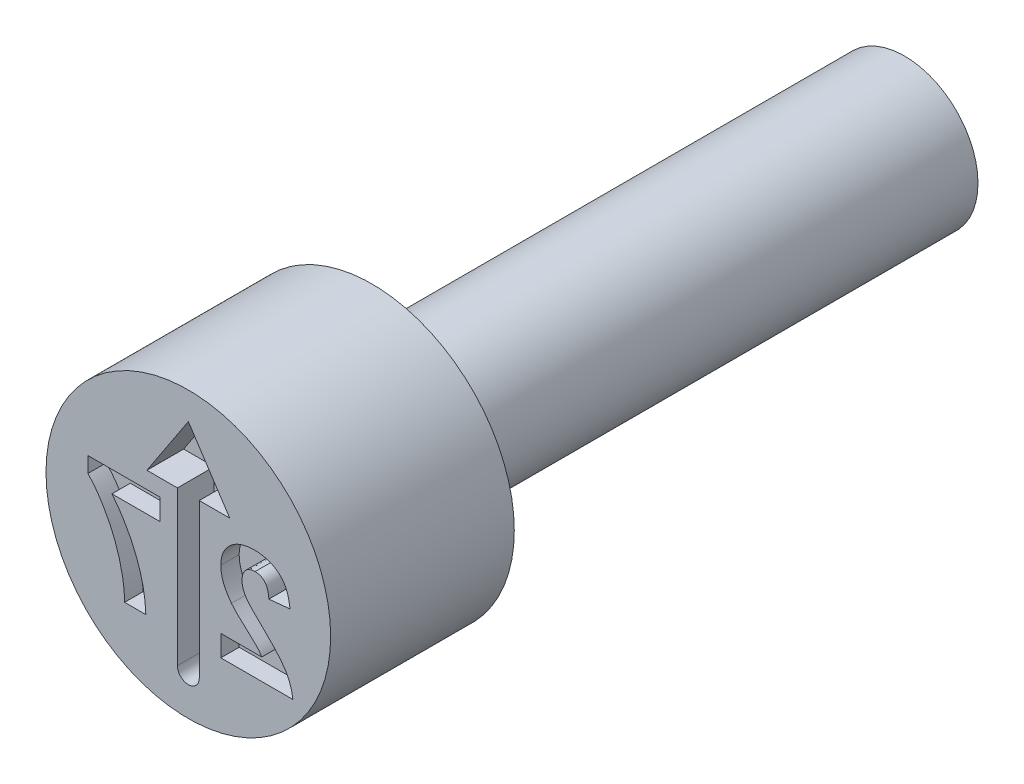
from build123d import *

# Parameters (mm, degrees)
CUT_EXTRUDE4_DEPTH = 0.4
CUT_EXTRUDE5_DEPTH = 0.2


with BuildPart() as part:
    # Sketch2 → Revolve1 (revolve)
    with BuildSketch(Plane(origin=(0, 0, 0), x_dir=(0, 0, -1), z_dir=(1, 0, 0)), mode=Mode.PRIVATE) as revolve1_sk:
        Polygon((0, 1.55), (0, 0), (7.8, 0), (7.8, 0.8), (2, 0.8), (2, 1.55), align=None)
    revolve(revolve1_sk.sketch.rotate(Axis((0, 0, -0.403888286), (0, 0, -1)), 90), axis=Axis((0, 0, -0.403888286), (0, 0, -1)))

    # Sketch3 → Cut-Extrude4 (cut)
    with BuildSketch(Plane.XY):
        with BuildLine():
            Line((0.119045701, 0.566469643), (0.119045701, -1.110101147))
            ThreePointArc((0.119045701, -1.110101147), (0, -1.229146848), (-0.119045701, -1.110101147))
            Line((-0.119045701, -1.110101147), (-0.119045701, 0.566469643))
            Line((-0.119045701, 0.566469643), (-0.451198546, 0.566469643))
            Line((-0.451198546, 0.566469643), (0, 1.251322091))
            Line((0, 1.251322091), (0.451198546, 0.566469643))
            Line((0.451198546, 0.566469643), (0.119045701, 0.566469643))
        make_face()
    extrude(amount=-CUT_EXTRUDE4_DEPTH, mode=Mode.SUBTRACT)

    # Sketch4 → Cut-Extrude5 (cut)
    with BuildSketch(Plane.XY):
        with BuildLine():
            Line((0.353846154, -0.569230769), (0.353846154, -0.8))
            Line((0.353846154, -0.8), (1.138461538, -0.8))
            add(Edge.make_bspline(
                [(1.138461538, -0.8), (1.135805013, -0.780277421), (1.13049345, -0.740843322), (1.114071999, -0.683240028), (1.092154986, -0.627029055), (1.068368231, -0.581286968), (1.044709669, -0.544466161), (1.023244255, -0.514294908), (0.997636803, -0.482193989), (0.968258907, -0.447904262), (0.935272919, -0.411318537), (0.898432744, -0.372572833), (0.857562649, -0.331852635), (0.828809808, -0.304201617), (0.813942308, -0.289903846)],
                knots=[0, 0, 0, 0, 1.156289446, 2.311930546, 3.473459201, 4.661751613, 5.303057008, 6.018253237, 6.81459331, 7.690699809, 8.644447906, 9.679642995, 10.800191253, 12, 12, 12, 12], degree=3))
            add(Edge.make_bspline(
                [(0.813942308, -0.289903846), (0.802077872, -0.278451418), (0.779491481, -0.256649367), (0.747328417, -0.225429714), (0.719053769, -0.196729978), (0.694076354, -0.171293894), (0.672973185, -0.148473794), (0.65546667, -0.128628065), (0.641335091, -0.111675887), (0.633681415, -0.100921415), (0.630288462, -0.096153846)],
                knots=[0, 0, 0, 0, 1.480720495, 2.818855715, 4.024636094, 5.098235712, 6.019786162, 6.815086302, 7.474715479, 8, 8, 8, 8], degree=3))
            add(Edge.make_bspline(
                [(0.630288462, -0.096153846), (0.623340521, -0.084612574), (0.609938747, -0.062350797), (0.595242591, -0.02734375), (0.58642141, 0.007656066), (0.585210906, 0.031042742), (0.584615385, 0.042548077)],
                knots=[0, 0, 0, 0, 1.0911822, 2.104764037, 3.067617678, 4, 4, 4, 4], degree=3))
            add(Edge.make_bspline(
                [(0.584615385, 0.042548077), (0.585047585, 0.054520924), (0.585865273, 0.077172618), (0.592721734, 0.109138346), (0.604880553, 0.136617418), (0.621621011, 0.159694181), (0.642789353, 0.177774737), (0.66753576, 0.191134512), (0.69622248, 0.198520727), (0.716385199, 0.199492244), (0.726923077, 0.2)],
                knots=[0, 0, 0, 0, 1.193122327, 2.257294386, 3.237245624, 4.168877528, 5.075331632, 5.990371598, 6.949684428, 8, 8, 8, 8], degree=3))
            add(Edge.make_bspline(
                [(0.726923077, 0.2), (0.737389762, 0.199525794), (0.757609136, 0.198609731), (0.786345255, 0.190607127), (0.811484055, 0.176753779), (0.829399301, 0.160966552), (0.8415019, 0.14561462), (0.849748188, 0.132236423), (0.856855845, 0.117034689), (0.863153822, 0.100180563), (0.868128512, 0.081480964), (0.872134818, 0.061078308), (0.875363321, 0.0388628), (0.876390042, 0.023408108), (0.876923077, 0.015384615)],
                knots=[0, 0, 0, 0, 1.402788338, 2.709884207, 3.961032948, 5.225417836, 5.883680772, 6.578928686, 7.329201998, 8.132101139, 8.990263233, 9.922304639, 10.921339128, 12, 12, 12, 12], degree=3))
            Line((0.876923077, 0.015384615), (1.107692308, 0.037980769))
            add(Edge.make_bspline(
                [(1.107692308, 0.037980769), (1.105836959, 0.053560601), (1.102239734, 0.083767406), (1.093262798, 0.127154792), (1.081893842, 0.167181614), (1.067590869, 0.20377359), (1.050945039, 0.237163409), (1.031107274, 0.266850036), (1.008770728, 0.293162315), (0.983916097, 0.316086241), (0.95670139, 0.335694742), (0.928144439, 0.353198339), (0.897687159, 0.367556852), (0.865664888, 0.379390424), (0.832092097, 0.38884772), (0.796813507, 0.395100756), (0.760046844, 0.399499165), (0.734949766, 0.399830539), (0.722115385, 0.4)],
                knots=[0, 0, 0, 0, 1.270971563, 2.464210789, 3.586263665, 4.638946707, 5.643716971, 6.603612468, 7.52484387, 8.434700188, 9.336036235, 10.239171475, 11.145359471, 12.059630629, 13.003312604, 13.96741569, 14.960557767, 16, 16, 16, 16], degree=3))
            add(Edge.make_bspline(
                [(0.722115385, 0.4), (0.708162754, 0.399731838), (0.680988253, 0.399209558), (0.641318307, 0.394896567), (0.604051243, 0.387376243), (0.568861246, 0.37741451), (0.536109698, 0.364114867), (0.505523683, 0.348036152), (0.47758457, 0.328568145), (0.451875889, 0.30677252), (0.428894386, 0.282804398), (0.408764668, 0.257238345), (0.391900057, 0.230092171), (0.377748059, 0.201696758), (0.367240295, 0.171595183), (0.359583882, 0.140203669), (0.354507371, 0.107375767), (0.354068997, 0.084955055), (0.353846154, 0.073557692)],
                knots=[0, 0, 0, 0, 1.210756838, 2.35810096, 3.457354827, 4.507168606, 5.527358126, 6.519769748, 7.499700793, 8.476517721, 9.440526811, 10.376769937, 11.295256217, 12.209626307, 13.124630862, 14.055668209, 15.011616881, 16, 16, 16, 16], degree=3))
            add(Edge.make_bspline(
                [(0.353846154, 0.073557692), (0.354139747, 0.060477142), (0.354722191, 0.034527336), (0.36029866, -0.003834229), (0.368818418, -0.041311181), (0.38140995, -0.07799511), (0.397370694, -0.114765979), (0.417944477, -0.151706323), (0.441832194, -0.189930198), (0.460535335, -0.214643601), (0.470192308, -0.227403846)],
                knots=[0, 0, 0, 0, 0.953409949, 1.89141903, 2.821310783, 3.752688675, 4.715703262, 5.740811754, 6.833515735, 8, 8, 8, 8], degree=3))
            add(Edge.make_bspline(
                [(0.470192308, -0.227403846), (0.473842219, -0.232000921), (0.481659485, -0.241846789), (0.494958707, -0.256943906), (0.510371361, -0.273434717), (0.527679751, -0.291627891), (0.547455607, -0.310879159), (0.568987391, -0.331993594), (0.593222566, -0.353891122), (0.618324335, -0.377117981), (0.643535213, -0.399724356), (0.666707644, -0.4211954), (0.687755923, -0.440192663), (0.70569979, -0.45776488), (0.7215947, -0.472712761), (0.734867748, -0.485802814), (0.745767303, -0.496718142), (0.760786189, -0.513732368), (0.779896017, -0.536744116), (0.793340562, -0.558732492), (0.799759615, -0.569230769)],
                knots=[0, 0, 0, 0, 0.665555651, 1.425465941, 2.280616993, 3.225313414, 4.272635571, 5.410053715, 6.644756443, 7.976022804, 9.288331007, 10.484517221, 11.558462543, 12.503158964, 13.33222979, 14.032602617, 14.617328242, 15.080653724, 16.606167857, 18, 18, 18, 18], degree=3))
            Line((0.799759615, -0.569230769), (0.353846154, -0.569230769))
        make_face()
        with BuildLine():
            Line((-0.308923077, 0.153846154), (-0.308923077, 0.384615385))
            Line((-0.308923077, 0.384615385), (-1.093538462, 0.384615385))
            Line((-1.093538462, 0.384615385), (-1.093538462, 0.215384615))
            add(Edge.make_bspline(
                [(-1.093538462, 0.215384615), (-1.085353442, 0.207056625), (-1.068527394, 0.18993667), (-1.044425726, 0.161918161), (-1.019966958, 0.131513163), (-0.995662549, 0.098311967), (-0.970757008, 0.062839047), (-0.946344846, 0.024414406), (-0.921585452, -0.016463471), (-0.888251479, -0.07428531), (-0.849288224, -0.149818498), (-0.808067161, -0.243710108), (-0.772948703, -0.340485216), (-0.748901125, -0.422944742), (-0.732653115, -0.489035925), (-0.722037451, -0.537363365), (-0.713101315, -0.584330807), (-0.705831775, -0.630020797), (-0.700406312, -0.674454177), (-0.696119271, -0.717476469), (-0.694004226, -0.759192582), (-0.693692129, -0.786536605), (-0.693538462, -0.8)],
                knots=[0, 0, 0, 0, 0.628545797, 1.29210959, 1.98878689, 2.729126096, 3.507039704, 4.322017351, 5.179550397, 6.080149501, 7.915136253, 9.752312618, 11.597470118, 13.454141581, 14.373891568, 15.261584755, 16.117868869, 16.947726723, 17.752002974, 18.527724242, 19.275094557, 20, 20, 20, 20], degree=3))
            Line((-0.693538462, -0.8), (-0.462769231, -0.8))
            add(Edge.make_bspline(
                [(-0.462769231, -0.8), (-0.463540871, -0.779556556), (-0.465092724, -0.738442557), (-0.470898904, -0.676731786), (-0.480018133, -0.61479123), (-0.491344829, -0.552477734), (-0.506298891, -0.489942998), (-0.523366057, -0.426955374), (-0.544040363, -0.363851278), (-0.567215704, -0.300751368), (-0.592800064, -0.238254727), (-0.620683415, -0.177136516), (-0.650793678, -0.117778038), (-0.682739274, -0.059970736), (-0.716891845, -0.003900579), (-0.753277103, 0.050371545), (-0.791378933, 0.103238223), (-0.818622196, 0.136979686), (-0.832240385, 0.153846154)],
                knots=[0, 0, 0, 0, 0.943249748, 1.896978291, 2.856365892, 3.829648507, 4.816416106, 5.820376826, 6.838120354, 7.877341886, 8.919613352, 9.951365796, 10.974227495, 11.988073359, 12.996274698, 14.000568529, 15.000536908, 16, 16, 16, 16], degree=3))
            Line((-0.832240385, 0.153846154), (-0.308923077, 0.153846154))
        make_face()
    extrude(amount=-CUT_EXTRUDE5_DEPTH, mode=Mode.SUBTRACT)


solid = part.part
